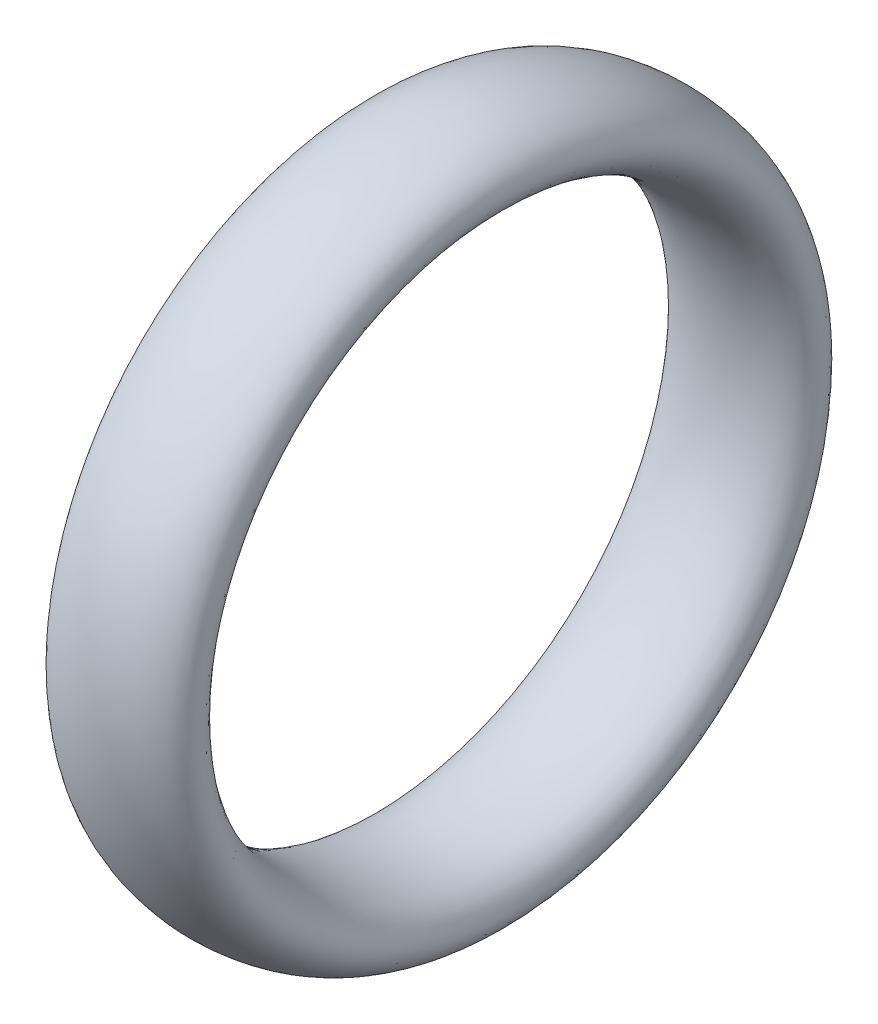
ISO-10303-21;
HEADER;
FILE_DESCRIPTION(('STEP AP214'),'2;1');
FILE_NAME('part.step','',(''),(''),'','','');
FILE_SCHEMA(('AUTOMOTIVE_DESIGN { 1 0 10303 214 1 1 1 1 }'));
ENDSEC;
DATA;
#1=APPLICATION_CONTEXT('core data for automotive mechanical design processes');
#2=APPLICATION_PROTOCOL_DEFINITION('international standard','automotive_design',2000,#1);
#3=PRODUCT_CONTEXT('',#1,'mechanical');
#4=PRODUCT('Part','Part','',(#3));
#5=PRODUCT_RELATED_PRODUCT_CATEGORY('part','',(#4));
#6=PRODUCT_DEFINITION_FORMATION('','',#4);
#7=PRODUCT_DEFINITION_CONTEXT('part definition',#1,'design');
#8=PRODUCT_DEFINITION('design','',#6,#7);
#9=PRODUCT_DEFINITION_SHAPE('','',#8);
#10=(LENGTH_UNIT() NAMED_UNIT(*) SI_UNIT(.MILLI.,.METRE.));
#11=(NAMED_UNIT(*) PLANE_ANGLE_UNIT() SI_UNIT($,.RADIAN.));
#12=(NAMED_UNIT(*) SI_UNIT($,.STERADIAN.) SOLID_ANGLE_UNIT());
#13=UNCERTAINTY_MEASURE_WITH_UNIT(LENGTH_MEASURE(1.E-05),#10,'distance_accuracy_value','');
#14=(GEOMETRIC_REPRESENTATION_CONTEXT(3) GLOBAL_UNCERTAINTY_ASSIGNED_CONTEXT((#13)) GLOBAL_UNIT_ASSIGNED_CONTEXT((#10,
#11,#12)) REPRESENTATION_CONTEXT('',''));
#15=CARTESIAN_POINT('',(0.,0.,0.));
#16=DIRECTION('',(0.,0.,1.));
#17=DIRECTION('',(1.,0.,0.));
#18=AXIS2_PLACEMENT_3D('',#15,#16,#17);
#19=CARTESIAN_POINT('',(-1.14299999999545,4.92125000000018,-7.7715611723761E-13));
#20=DIRECTION('',(0.,0.,1.00000000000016));
#21=DIRECTION('',(1.,0.,0.));
#22=AXIS2_PLACEMENT_3D('',#19,#20,#21);
#23=ELLIPSE('',#22,1.143,0.60325);
#24=CARTESIAN_POINT('',(1.05215218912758,0.,0.));
#25=DIRECTION('',(1.,0.,0.));
#26=AXIS1_PLACEMENT('',#24,#25);
#27=SURFACE_OF_REVOLUTION('',#23,#26);
#28=ADVANCED_FACE('F27',(),#27,.F.);
#29=CLOSED_SHELL('',(#28));
#30=MANIFOLD_SOLID_BREP('B2',#29);
#31=ADVANCED_BREP_SHAPE_REPRESENTATION('',(#18,#30),#14);
#32=SHAPE_DEFINITION_REPRESENTATION(#9,#31);
ENDSEC;
END-ISO-10303-21;
